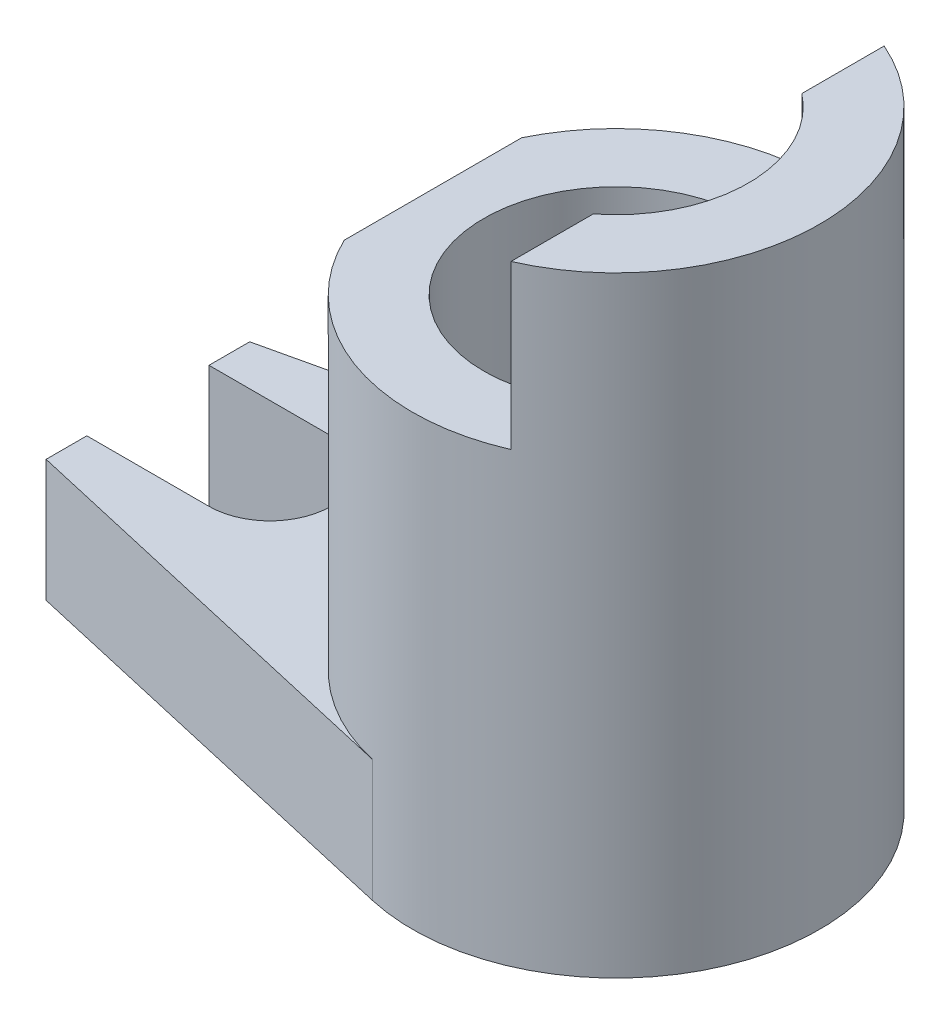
from build123d import *

# Parameters (mm, degrees)
EXTRUDE_1_DEPTH     = 30
CUT_EXTRUDE_1_DEPTH = 129.937969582
SKETCH_3_R          = 50
SKETCH_3_R_2        = 32.5
EXTRUDE_2_DEPTH     = 120
SKETCH_4_W          = 90.086220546
SKETCH_4_H          = 126.173390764
CUT_EXTRUDE_2_DEPTH = 40
SKETCH_5_W          = 17.648470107
SKETCH_5_H          = 54.262460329
CUT_EXTRUDE_3_DEPTH = 40


with BuildPart() as part:
    # Sketch 1 → Extrude 1 (new body)
    with BuildSketch(Plane(origin=(0, 0, 0), x_dir=(1, 0, 0), z_dir=(0, 1, 0))):
        with BuildLine():
            Line((-11.142926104, 48.74253992), (-115, 25))
            Line((-115, 25), (-115, -25))
            Line((-115, -25), (-11.142926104, -48.74253992))
            ThreePointArc((-11.142926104, -48.74253992), (50, 0), (-11.142926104, 48.74253992))
        make_face()
    extrude(amount=EXTRUDE_1_DEPTH)

    # Sketch 2 → Cut-Extrude 1 (cut, through all)
    with BuildSketch(Plane(origin=(0, 30, 0), x_dir=(1, 0, 0), z_dir=(0, 1, 0))):
        with BuildLine():
            Line((-115, -15), (-85, -15))
            ThreePointArc((-85, -15), (-70, 0), (-85, 15))
            Line((-85, 15), (-115, 15))
            ThreePointArc((-115, 15), (-130, 0), (-115, -15))
        make_face()
    extrude(amount=-CUT_EXTRUDE_1_DEPTH, mode=Mode.SUBTRACT)

    # Sketch 3 → Extrude 2 (add)
    with BuildSketch(Plane(origin=(0, 30, 0), x_dir=(1, 0, 0), z_dir=(0, 1, 0))):
        with Locations(Location((0, 0, 0), (0, 0, 102.876983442))):
            Circle(SKETCH_3_R)
        with Locations(Location((0, 0, 0), (0, 0, 270))):
            Circle(SKETCH_3_R_2, mode=Mode.SUBTRACT)
    extrude(amount=EXTRUDE_2_DEPTH)

    # Sketch 4 → Cut-Extrude 2 (cut)
    with BuildSketch(Plane(origin=(0, 150, 0), x_dir=(1, 0, 0), z_dir=(0, 1, 0))):
        with Locations((-25.043110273, 0.658525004)):
            Rectangle(SKETCH_4_W, SKETCH_4_H)
    extrude(amount=-CUT_EXTRUDE_2_DEPTH, mode=Mode.SUBTRACT)

    # Sketch 5 → Cut-Extrude 3 (cut)
    with BuildSketch(Plane(origin=(0, 110, 0), x_dir=(1, 0, 0), z_dir=(0, 1, 0))):
        with Locations((-53.824235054, -2.107280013)):
            Rectangle(SKETCH_5_W, SKETCH_5_H)
    extrude(amount=-CUT_EXTRUDE_3_DEPTH, mode=Mode.SUBTRACT)


solid = part.part
